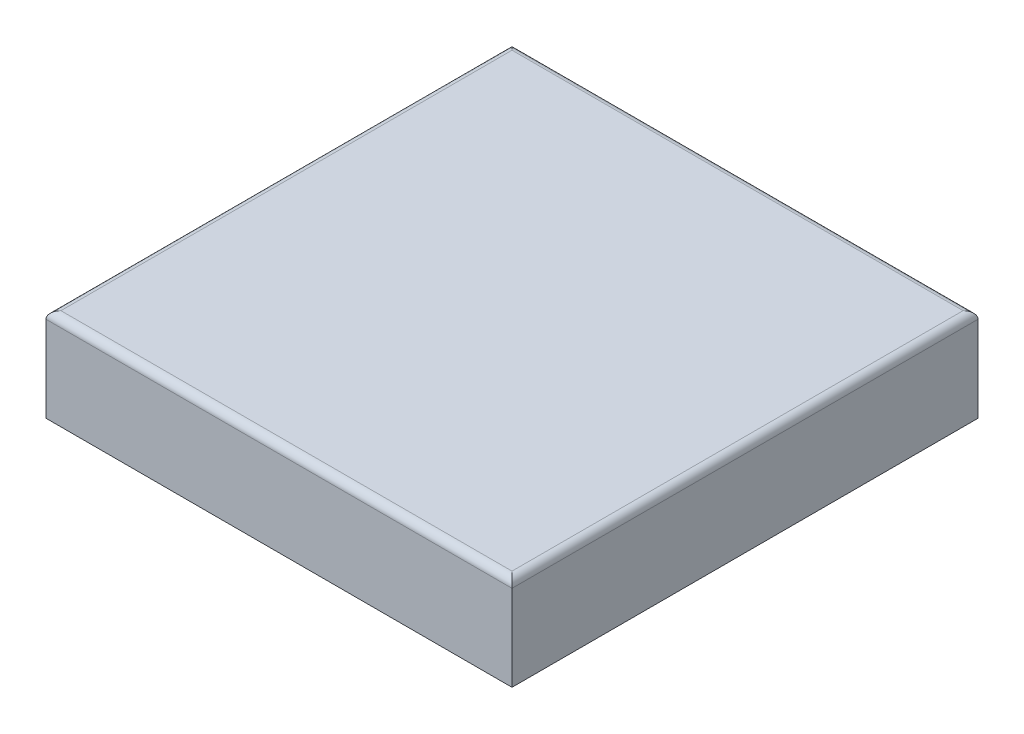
ISO-10303-21;
HEADER;
FILE_DESCRIPTION(('STEP AP214'),'2;1');
FILE_NAME('part.step','',(''),(''),'','','');
FILE_SCHEMA(('AUTOMOTIVE_DESIGN { 1 0 10303 214 1 1 1 1 }'));
ENDSEC;
DATA;
#1=APPLICATION_CONTEXT('core data for automotive mechanical design processes');
#2=APPLICATION_PROTOCOL_DEFINITION('international standard','automotive_design',2000,#1);
#3=PRODUCT_CONTEXT('',#1,'mechanical');
#4=PRODUCT('Part','Part','',(#3));
#5=PRODUCT_RELATED_PRODUCT_CATEGORY('part','',(#4));
#6=PRODUCT_DEFINITION_FORMATION('','',#4);
#7=PRODUCT_DEFINITION_CONTEXT('part definition',#1,'design');
#8=PRODUCT_DEFINITION('design','',#6,#7);
#9=PRODUCT_DEFINITION_SHAPE('','',#8);
#10=(LENGTH_UNIT() NAMED_UNIT(*) SI_UNIT(.MILLI.,.METRE.));
#11=(NAMED_UNIT(*) PLANE_ANGLE_UNIT() SI_UNIT($,.RADIAN.));
#12=(NAMED_UNIT(*) SI_UNIT($,.STERADIAN.) SOLID_ANGLE_UNIT());
#13=UNCERTAINTY_MEASURE_WITH_UNIT(LENGTH_MEASURE(1.E-05),#10,'distance_accuracy_value','');
#14=(GEOMETRIC_REPRESENTATION_CONTEXT(3) GLOBAL_UNCERTAINTY_ASSIGNED_CONTEXT((#13)) GLOBAL_UNIT_ASSIGNED_CONTEXT((#10,
#11,#12)) REPRESENTATION_CONTEXT('',''));
#15=CARTESIAN_POINT('',(0.,0.,0.));
#16=DIRECTION('',(0.,0.,1.));
#17=DIRECTION('',(1.,0.,0.));
#18=AXIS2_PLACEMENT_3D('',#15,#16,#17);
#19=CARTESIAN_POINT('',(-7.9375,1.5875,7.9375));
#20=DIRECTION('',(0.,-1.,0.));
#21=DIRECTION('',(0.,0.,-1.));
#22=AXIS2_PLACEMENT_3D('',#19,#20,#21);
#23=PLANE('',#22);
#24=CARTESIAN_POINT('',(-3.81000000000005,1.5875,0.));
#25=DIRECTION('',(0.,-1.,0.));
#26=DIRECTION('',(0.,0.,-1.));
#27=AXIS2_PLACEMENT_3D('',#24,#25,#26);
#28=CIRCLE('',#27,1.27);
#29=CARTESIAN_POINT('',(-3.81000000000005,1.5875,1.27));
#30=VERTEX_POINT('',#29);
#31=EDGE_CURVE('E233',#30,#30,#28,.T.);
#32=ORIENTED_EDGE('',*,*,#31,.F.);
#33=EDGE_LOOP('',(#32));
#34=FACE_BOUND('',#33,.T.);
#35=DIRECTION('',(0.,0.,1.));
#36=VECTOR('',#35,1.);
#37=CARTESIAN_POINT('',(-6.35,1.5875,7.9375));
#38=LINE('',#37,#36);
#39=CARTESIAN_POINT('',(-6.35,1.5875,-6.35));
#40=VERTEX_POINT('',#39);
#41=CARTESIAN_POINT('',(-6.35,1.5875,6.35));
#42=VERTEX_POINT('',#41);
#43=EDGE_CURVE('E115',#40,#42,#38,.T.);
#44=ORIENTED_EDGE('',*,*,#43,.F.);
#45=DIRECTION('',(1.,0.,0.));
#46=VECTOR('',#45,1.);
#47=CARTESIAN_POINT('',(-7.9375,1.5875,-6.35));
#48=LINE('',#47,#46);
#49=CARTESIAN_POINT('',(6.35,1.5875,-6.35));
#50=VERTEX_POINT('',#49);
#51=EDGE_CURVE('E143',#40,#50,#48,.T.);
#52=ORIENTED_EDGE('',*,*,#51,.T.);
#53=DIRECTION('',(0.,0.,-1.));
#54=VECTOR('',#53,1.);
#55=CARTESIAN_POINT('',(6.35,1.5875,7.9375));
#56=LINE('',#55,#54);
#57=CARTESIAN_POINT('',(6.35,1.5875,6.35));
#58=VERTEX_POINT('',#57);
#59=EDGE_CURVE('E141',#58,#50,#56,.T.);
#60=ORIENTED_EDGE('',*,*,#59,.F.);
#61=DIRECTION('',(-1.,0.,0.));
#62=VECTOR('',#61,1.);
#63=CARTESIAN_POINT('',(-7.9375,1.5875,6.35));
#64=LINE('',#63,#62);
#65=EDGE_CURVE('E126',#58,#42,#64,.T.);
#66=ORIENTED_EDGE('',*,*,#65,.T.);
#67=EDGE_LOOP('',(#44,#52,#60,#66));
#68=FACE_BOUND('',#67,.T.);
#69=CARTESIAN_POINT('',(0.,1.5875,3.80999999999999));
#70=DIRECTION('',(0.,-1.,0.));
#71=DIRECTION('',(0.,0.,-1.));
#72=AXIS2_PLACEMENT_3D('',#69,#70,#71);
#73=CIRCLE('',#72,1.27);
#74=CARTESIAN_POINT('',(0.,1.5875,5.07999999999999));
#75=VERTEX_POINT('',#74);
#76=EDGE_CURVE('E227',#75,#75,#73,.T.);
#77=ORIENTED_EDGE('',*,*,#76,.F.);
#78=EDGE_LOOP('',(#77));
#79=FACE_BOUND('',#78,.T.);
#80=ADVANCED_FACE('F40',(#34,#68,#79),#23,.T.);
#81=CARTESIAN_POINT('',(-7.9375,0.,7.9375));
#82=DIRECTION('',(0.,-1.,0.));
#83=DIRECTION('',(0.,0.,-1.));
#84=AXIS2_PLACEMENT_3D('',#81,#82,#83);
#85=PLANE('',#84);
#86=DIRECTION('',(0.,0.,1.));
#87=VECTOR('',#86,1.);
#88=CARTESIAN_POINT('',(-7.9375,0.,-7.9375));
#89=LINE('',#88,#87);
#90=CARTESIAN_POINT('',(-7.9375,0.,-7.9375));
#91=VERTEX_POINT('',#90);
#92=CARTESIAN_POINT('',(-7.9375,0.,7.9375));
#93=VERTEX_POINT('',#92);
#94=EDGE_CURVE('E136',#91,#93,#89,.T.);
#95=ORIENTED_EDGE('',*,*,#94,.F.);
#96=DIRECTION('',(1.,0.,0.));
#97=VECTOR('',#96,1.);
#98=CARTESIAN_POINT('',(-7.9375,0.,-7.9375));
#99=LINE('',#98,#97);
#100=CARTESIAN_POINT('',(7.9375,0.,-7.9375));
#101=VERTEX_POINT('',#100);
#102=EDGE_CURVE('E168',#91,#101,#99,.T.);
#103=ORIENTED_EDGE('',*,*,#102,.T.);
#104=DIRECTION('',(0.,0.,-1.));
#105=VECTOR('',#104,1.);
#106=CARTESIAN_POINT('',(7.9375,0.,7.9375));
#107=LINE('',#106,#105);
#108=CARTESIAN_POINT('',(7.9375,0.,7.9375));
#109=VERTEX_POINT('',#108);
#110=EDGE_CURVE('E165',#109,#101,#107,.T.);
#111=ORIENTED_EDGE('',*,*,#110,.F.);
#112=DIRECTION('',(-1.,0.,0.));
#113=VECTOR('',#112,1.);
#114=CARTESIAN_POINT('',(7.9375,0.,7.9375));
#115=LINE('',#114,#113);
#116=EDGE_CURVE('E162',#109,#93,#115,.T.);
#117=ORIENTED_EDGE('',*,*,#116,.T.);
#118=EDGE_LOOP('',(#95,#103,#111,#117));
#119=FACE_BOUND('',#118,.T.);
#120=DIRECTION('',(1.,0.,0.));
#121=VECTOR('',#120,1.);
#122=CARTESIAN_POINT('',(-7.9375,0.,-6.35));
#123=LINE('',#122,#121);
#124=CARTESIAN_POINT('',(-6.35,0.,-6.35));
#125=VERTEX_POINT('',#124);
#126=CARTESIAN_POINT('',(6.35,0.,-6.35));
#127=VERTEX_POINT('',#126);
#128=EDGE_CURVE('E127',#125,#127,#123,.T.);
#129=ORIENTED_EDGE('',*,*,#128,.F.);
#130=DIRECTION('',(0.,0.,1.));
#131=VECTOR('',#130,1.);
#132=CARTESIAN_POINT('',(-6.35,0.,7.9375));
#133=LINE('',#132,#131);
#134=CARTESIAN_POINT('',(-6.35,0.,6.35));
#135=VERTEX_POINT('',#134);
#136=EDGE_CURVE('E151',#125,#135,#133,.T.);
#137=ORIENTED_EDGE('',*,*,#136,.T.);
#138=DIRECTION('',(-1.,0.,0.));
#139=VECTOR('',#138,1.);
#140=CARTESIAN_POINT('',(-7.9375,0.,6.35));
#141=LINE('',#140,#139);
#142=CARTESIAN_POINT('',(6.35,0.,6.35));
#143=VERTEX_POINT('',#142);
#144=EDGE_CURVE('E134',#143,#135,#141,.T.);
#145=ORIENTED_EDGE('',*,*,#144,.F.);
#146=DIRECTION('',(0.,0.,-1.));
#147=VECTOR('',#146,1.);
#148=CARTESIAN_POINT('',(6.35,0.,7.9375));
#149=LINE('',#148,#147);
#150=EDGE_CURVE('E156',#143,#127,#149,.T.);
#151=ORIENTED_EDGE('',*,*,#150,.T.);
#152=EDGE_LOOP('',(#129,#137,#145,#151));
#153=FACE_BOUND('',#152,.T.);
#154=ADVANCED_FACE('F242',(#119,#153),#85,.T.);
#155=CARTESIAN_POINT('',(-7.9375,3.175,-7.9375));
#156=DIRECTION('',(1.,0.,0.));
#157=DIRECTION('',(0.,0.,-1.));
#158=AXIS2_PLACEMENT_3D('',#155,#156,#157);
#159=PLANE('',#158);
#160=DIRECTION('',(0.,-1.,0.));
#161=VECTOR('',#160,1.);
#162=CARTESIAN_POINT('',(-7.9375,3.175,7.9375));
#163=LINE('',#162,#161);
#164=CARTESIAN_POINT('',(-7.9375,2.921,7.9375));
#165=VERTEX_POINT('',#164);
#166=EDGE_CURVE('E177',#165,#93,#163,.T.);
#167=ORIENTED_EDGE('',*,*,#166,.F.);
#168=DIRECTION('',(0.,0.,1.));
#169=VECTOR('',#168,1.);
#170=CARTESIAN_POINT('',(-7.9375,2.921,-7.9375));
#171=LINE('',#170,#169);
#172=CARTESIAN_POINT('',(-7.9375,2.921,-7.9375));
#173=VERTEX_POINT('',#172);
#174=EDGE_CURVE('E11',#165,#173,#171,.F.);
#175=ORIENTED_EDGE('',*,*,#174,.T.);
#176=DIRECTION('',(0.,-1.,0.));
#177=VECTOR('',#176,1.);
#178=CARTESIAN_POINT('',(-7.9375,3.175,-7.9375));
#179=LINE('',#178,#177);
#180=EDGE_CURVE('E171',#173,#91,#179,.T.);
#181=ORIENTED_EDGE('',*,*,#180,.T.);
#182=ORIENTED_EDGE('',*,*,#94,.T.);
#183=EDGE_LOOP('',(#167,#175,#181,#182));
#184=FACE_BOUND('',#183,.T.);
#185=ADVANCED_FACE('F42',(#184),#159,.F.);
#186=CARTESIAN_POINT('',(7.9375,3.175,7.9375));
#187=DIRECTION('',(0.,0.,1.));
#188=DIRECTION('',(1.,0.,0.));
#189=AXIS2_PLACEMENT_3D('',#186,#187,#188);
#190=PLANE('',#189);
#191=DIRECTION('',(0.,-1.,0.));
#192=VECTOR('',#191,1.);
#193=CARTESIAN_POINT('',(7.9375,3.175,7.9375));
#194=LINE('',#193,#192);
#195=CARTESIAN_POINT('',(7.9375,2.921,7.9375));
#196=VERTEX_POINT('',#195);
#197=EDGE_CURVE('E175',#196,#109,#194,.T.);
#198=ORIENTED_EDGE('',*,*,#197,.F.);
#199=DIRECTION('',(-1.,0.,0.));
#200=VECTOR('',#199,1.);
#201=CARTESIAN_POINT('',(-7.9375,2.921,7.9375));
#202=LINE('',#201,#200);
#203=EDGE_CURVE('E48',#196,#165,#202,.T.);
#204=ORIENTED_EDGE('',*,*,#203,.T.);
#205=ORIENTED_EDGE('',*,*,#166,.T.);
#206=ORIENTED_EDGE('',*,*,#116,.F.);
#207=EDGE_LOOP('',(#198,#204,#205,#206));
#208=FACE_BOUND('',#207,.T.);
#209=ADVANCED_FACE('F272',(#208),#190,.T.);
#210=CARTESIAN_POINT('',(7.9375,3.175,7.9375));
#211=DIRECTION('',(-1.,0.,0.));
#212=DIRECTION('',(0.,0.,1.));
#213=AXIS2_PLACEMENT_3D('',#210,#211,#212);
#214=PLANE('',#213);
#215=DIRECTION('',(0.,-1.,0.));
#216=VECTOR('',#215,1.);
#217=CARTESIAN_POINT('',(7.9375,3.175,-7.9375));
#218=LINE('',#217,#216);
#219=CARTESIAN_POINT('',(7.9375,2.921,-7.9375));
#220=VERTEX_POINT('',#219);
#221=EDGE_CURVE('E173',#220,#101,#218,.T.);
#222=ORIENTED_EDGE('',*,*,#221,.F.);
#223=DIRECTION('',(0.,0.,-1.));
#224=VECTOR('',#223,1.);
#225=CARTESIAN_POINT('',(7.9375,2.921,7.9375));
#226=LINE('',#225,#224);
#227=EDGE_CURVE('E62',#220,#196,#226,.F.);
#228=ORIENTED_EDGE('',*,*,#227,.T.);
#229=ORIENTED_EDGE('',*,*,#197,.T.);
#230=ORIENTED_EDGE('',*,*,#110,.T.);
#231=EDGE_LOOP('',(#222,#228,#229,#230));
#232=FACE_BOUND('',#231,.T.);
#233=ADVANCED_FACE('F269',(#232),#214,.F.);
#234=CARTESIAN_POINT('',(-7.9375,3.175,-7.9375));
#235=DIRECTION('',(0.,0.,-1.));
#236=DIRECTION('',(-1.,0.,0.));
#237=AXIS2_PLACEMENT_3D('',#234,#235,#236);
#238=PLANE('',#237);
#239=ORIENTED_EDGE('',*,*,#180,.F.);
#240=DIRECTION('',(1.,0.,0.));
#241=VECTOR('',#240,1.);
#242=CARTESIAN_POINT('',(7.9375,2.921,-7.9375));
#243=LINE('',#242,#241);
#244=EDGE_CURVE('E179',#173,#220,#243,.T.);
#245=ORIENTED_EDGE('',*,*,#244,.T.);
#246=ORIENTED_EDGE('',*,*,#221,.T.);
#247=ORIENTED_EDGE('',*,*,#102,.F.);
#248=EDGE_LOOP('',(#239,#245,#246,#247));
#249=FACE_BOUND('',#248,.T.);
#250=ADVANCED_FACE('F266',(#249),#238,.T.);
#251=CARTESIAN_POINT('',(-7.9375,3.175,7.9375));
#252=DIRECTION('',(0.,-1.,0.));
#253=DIRECTION('',(0.,0.,-1.));
#254=AXIS2_PLACEMENT_3D('',#251,#252,#253);
#255=PLANE('',#254);
#256=DIRECTION('',(0.,0.,-1.));
#257=VECTOR('',#256,1.);
#258=CARTESIAN_POINT('',(7.6835,3.175,7.9375));
#259=LINE('',#258,#257);
#260=CARTESIAN_POINT('',(7.6835,3.175,7.6835));
#261=VERTEX_POINT('',#260);
#262=CARTESIAN_POINT('',(7.6835,3.175,-7.6835));
#263=VERTEX_POINT('',#262);
#264=EDGE_CURVE('E186',#261,#263,#259,.T.);
#265=ORIENTED_EDGE('',*,*,#264,.T.);
#266=DIRECTION('',(1.,0.,0.));
#267=VECTOR('',#266,1.);
#268=CARTESIAN_POINT('',(-7.9375,3.175,-7.6835));
#269=LINE('',#268,#267);
#270=CARTESIAN_POINT('',(-7.6835,3.175,-7.6835));
#271=VERTEX_POINT('',#270);
#272=EDGE_CURVE('E188',#263,#271,#269,.F.);
#273=ORIENTED_EDGE('',*,*,#272,.T.);
#274=DIRECTION('',(0.,0.,1.));
#275=VECTOR('',#274,1.);
#276=CARTESIAN_POINT('',(-7.6835,3.175,7.9375));
#277=LINE('',#276,#275);
#278=CARTESIAN_POINT('',(-7.6835,3.175,7.6835));
#279=VERTEX_POINT('',#278);
#280=EDGE_CURVE('E182',#271,#279,#277,.T.);
#281=ORIENTED_EDGE('',*,*,#280,.T.);
#282=DIRECTION('',(-1.,0.,0.));
#283=VECTOR('',#282,1.);
#284=CARTESIAN_POINT('',(7.9375,3.175,7.6835));
#285=LINE('',#284,#283);
#286=EDGE_CURVE('E184',#279,#261,#285,.F.);
#287=ORIENTED_EDGE('',*,*,#286,.T.);
#288=EDGE_LOOP('',(#265,#273,#281,#287));
#289=FACE_BOUND('',#288,.T.);
#290=ADVANCED_FACE('F193',(#289),#255,.F.);
#291=CARTESIAN_POINT('',(-6.35,3.175,-7.9375));
#292=DIRECTION('',(1.,0.,0.));
#293=DIRECTION('',(0.,0.,-1.));
#294=AXIS2_PLACEMENT_3D('',#291,#292,#293);
#295=PLANE('',#294);
#296=ORIENTED_EDGE('',*,*,#136,.F.);
#297=DIRECTION('',(0.,-1.,0.));
#298=VECTOR('',#297,1.);
#299=CARTESIAN_POINT('',(-6.35,3.175,-6.35));
#300=LINE('',#299,#298);
#301=EDGE_CURVE('E121',#40,#125,#300,.T.);
#302=ORIENTED_EDGE('',*,*,#301,.F.);
#303=ORIENTED_EDGE('',*,*,#43,.T.);
#304=DIRECTION('',(0.,-1.,0.));
#305=VECTOR('',#304,1.);
#306=CARTESIAN_POINT('',(-6.35,3.175,6.35));
#307=LINE('',#306,#305);
#308=EDGE_CURVE('E119',#42,#135,#307,.T.);
#309=ORIENTED_EDGE('',*,*,#308,.T.);
#310=EDGE_LOOP('',(#296,#302,#303,#309));
#311=FACE_BOUND('',#310,.T.);
#312=ADVANCED_FACE('F118',(#311),#295,.T.);
#313=CARTESIAN_POINT('',(7.9375,3.175,6.35));
#314=DIRECTION('',(0.,0.,1.));
#315=DIRECTION('',(1.,0.,0.));
#316=AXIS2_PLACEMENT_3D('',#313,#314,#315);
#317=PLANE('',#316);
#318=ORIENTED_EDGE('',*,*,#144,.T.);
#319=ORIENTED_EDGE('',*,*,#308,.F.);
#320=ORIENTED_EDGE('',*,*,#65,.F.);
#321=DIRECTION('',(0.,-1.,0.));
#322=VECTOR('',#321,1.);
#323=CARTESIAN_POINT('',(6.35,3.175,6.35));
#324=LINE('',#323,#322);
#325=EDGE_CURVE('E137',#58,#143,#324,.T.);
#326=ORIENTED_EDGE('',*,*,#325,.T.);
#327=EDGE_LOOP('',(#318,#319,#320,#326));
#328=FACE_BOUND('',#327,.T.);
#329=ADVANCED_FACE('F131',(#328),#317,.F.);
#330=CARTESIAN_POINT('',(6.35,3.175,7.9375));
#331=DIRECTION('',(-1.,0.,0.));
#332=DIRECTION('',(0.,0.,1.));
#333=AXIS2_PLACEMENT_3D('',#330,#331,#332);
#334=PLANE('',#333);
#335=ORIENTED_EDGE('',*,*,#150,.F.);
#336=ORIENTED_EDGE('',*,*,#325,.F.);
#337=ORIENTED_EDGE('',*,*,#59,.T.);
#338=DIRECTION('',(0.,-1.,0.));
#339=VECTOR('',#338,1.);
#340=CARTESIAN_POINT('',(6.35,3.175,-6.35));
#341=LINE('',#340,#339);
#342=EDGE_CURVE('E148',#50,#127,#341,.T.);
#343=ORIENTED_EDGE('',*,*,#342,.T.);
#344=EDGE_LOOP('',(#335,#336,#337,#343));
#345=FACE_BOUND('',#344,.T.);
#346=ADVANCED_FACE('F244',(#345),#334,.T.);
#347=CARTESIAN_POINT('',(-7.9375,3.175,-6.35));
#348=DIRECTION('',(0.,0.,-1.));
#349=DIRECTION('',(-1.,0.,0.));
#350=AXIS2_PLACEMENT_3D('',#347,#348,#349);
#351=PLANE('',#350);
#352=ORIENTED_EDGE('',*,*,#128,.T.);
#353=ORIENTED_EDGE('',*,*,#342,.F.);
#354=ORIENTED_EDGE('',*,*,#51,.F.);
#355=ORIENTED_EDGE('',*,*,#301,.T.);
#356=EDGE_LOOP('',(#352,#353,#354,#355));
#357=FACE_BOUND('',#356,.T.);
#358=ADVANCED_FACE('F238',(#357),#351,.F.);
#359=CARTESIAN_POINT('',(-3.81000000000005,-3.59210244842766,0.));
#360=DIRECTION('',(0.,1.,0.));
#361=DIRECTION('',(0.,0.,1.));
#362=AXIS2_PLACEMENT_3D('',#359,#360,#361);
#363=CYLINDRICAL_SURFACE('',#362,1.27);
#364=CARTESIAN_POINT('',(-3.81000000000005,0.,0.));
#365=DIRECTION('',(0.,-1.,0.));
#366=DIRECTION('',(0.,0.,-1.));
#367=AXIS2_PLACEMENT_3D('',#364,#365,#366);
#368=CIRCLE('',#367,1.27);
#369=CARTESIAN_POINT('',(-3.81000000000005,0.,1.27));
#370=VERTEX_POINT('',#369);
#371=EDGE_CURVE('E153',#370,#370,#368,.T.);
#372=CARTESIAN_POINT('',(-3.81000000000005,1.5875,1.27));
#373=CARTESIAN_POINT('',(-3.81000000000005,1.57096354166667,1.27));
#374=CARTESIAN_POINT('',(-3.81000000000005,1.55442708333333,1.27));
#375=CARTESIAN_POINT('',(-3.81000000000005,1.52135416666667,1.27));
#376=CARTESIAN_POINT('',(-3.81000000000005,1.50481770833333,1.27));
#377=CARTESIAN_POINT('',(-3.81000000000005,1.47174479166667,1.27));
#378=CARTESIAN_POINT('',(-3.81000000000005,1.45520833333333,1.27));
#379=CARTESIAN_POINT('',(-3.81000000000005,1.42213541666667,1.27));
#380=CARTESIAN_POINT('',(-3.81000000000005,1.40559895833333,1.27));
#381=CARTESIAN_POINT('',(-3.81000000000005,1.37252604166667,1.27));
#382=CARTESIAN_POINT('',(-3.81000000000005,1.35598958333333,1.27));
#383=CARTESIAN_POINT('',(-3.81000000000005,1.32291666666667,1.27));
#384=CARTESIAN_POINT('',(-3.81000000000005,1.30638020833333,1.27));
#385=CARTESIAN_POINT('',(-3.81000000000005,1.27330729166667,1.27));
#386=CARTESIAN_POINT('',(-3.81000000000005,1.25677083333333,1.27));
#387=CARTESIAN_POINT('',(-3.81000000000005,1.22369791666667,1.27));
#388=CARTESIAN_POINT('',(-3.81000000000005,1.20716145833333,1.27));
#389=CARTESIAN_POINT('',(-3.81000000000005,1.17408854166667,1.27));
#390=CARTESIAN_POINT('',(-3.81000000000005,1.15755208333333,1.27));
#391=CARTESIAN_POINT('',(-3.81000000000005,1.12447916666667,1.27));
#392=CARTESIAN_POINT('',(-3.81000000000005,1.10794270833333,1.27));
#393=CARTESIAN_POINT('',(-3.81000000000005,1.07486979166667,1.27));
#394=CARTESIAN_POINT('',(-3.81000000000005,1.05833333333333,1.27));
#395=CARTESIAN_POINT('',(-3.81000000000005,1.02526041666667,1.27));
#396=CARTESIAN_POINT('',(-3.81000000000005,1.00872395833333,1.27));
#397=CARTESIAN_POINT('',(-3.81000000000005,0.975651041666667,1.27));
#398=CARTESIAN_POINT('',(-3.81000000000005,0.959114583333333,1.27));
#399=CARTESIAN_POINT('',(-3.81000000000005,0.926041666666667,1.27));
#400=CARTESIAN_POINT('',(-3.81000000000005,0.909505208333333,1.27));
#401=CARTESIAN_POINT('',(-3.81000000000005,0.876432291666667,1.27));
#402=CARTESIAN_POINT('',(-3.81000000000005,0.859895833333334,1.27));
#403=CARTESIAN_POINT('',(-3.81000000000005,0.826822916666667,1.27));
#404=CARTESIAN_POINT('',(-3.81000000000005,0.810286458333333,1.27));
#405=CARTESIAN_POINT('',(-3.81000000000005,0.777213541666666,1.27));
#406=CARTESIAN_POINT('',(-3.81000000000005,0.760677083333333,1.27));
#407=CARTESIAN_POINT('',(-3.81000000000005,0.727604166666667,1.27));
#408=CARTESIAN_POINT('',(-3.81000000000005,0.711067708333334,1.27));
#409=CARTESIAN_POINT('',(-3.81000000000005,0.677994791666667,1.27));
#410=CARTESIAN_POINT('',(-3.81000000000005,0.661458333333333,1.27));
#411=CARTESIAN_POINT('',(-3.81000000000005,0.628385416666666,1.27));
#412=CARTESIAN_POINT('',(-3.81000000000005,0.611848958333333,1.27));
#413=CARTESIAN_POINT('',(-3.81000000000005,0.578776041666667,1.27));
#414=CARTESIAN_POINT('',(-3.81000000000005,0.562239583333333,1.27));
#415=CARTESIAN_POINT('',(-3.81000000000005,0.529166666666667,1.27));
#416=CARTESIAN_POINT('',(-3.81000000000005,0.512630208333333,1.27));
#417=CARTESIAN_POINT('',(-3.81000000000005,0.479557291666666,1.27));
#418=CARTESIAN_POINT('',(-3.81000000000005,0.463020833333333,1.27));
#419=CARTESIAN_POINT('',(-3.81000000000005,0.429947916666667,1.27));
#420=CARTESIAN_POINT('',(-3.81000000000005,0.413411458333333,1.27));
#421=CARTESIAN_POINT('',(-3.81000000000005,0.380338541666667,1.27));
#422=CARTESIAN_POINT('',(-3.81000000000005,0.363802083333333,1.27));
#423=CARTESIAN_POINT('',(-3.81000000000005,0.330729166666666,1.27));
#424=CARTESIAN_POINT('',(-3.81000000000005,0.314192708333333,1.27));
#425=CARTESIAN_POINT('',(-3.81000000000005,0.281119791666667,1.27));
#426=CARTESIAN_POINT('',(-3.81000000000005,0.264583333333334,1.27));
#427=CARTESIAN_POINT('',(-3.81000000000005,0.231510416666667,1.27));
#428=CARTESIAN_POINT('',(-3.81000000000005,0.214973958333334,1.27));
#429=CARTESIAN_POINT('',(-3.81000000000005,0.181901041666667,1.27));
#430=CARTESIAN_POINT('',(-3.81000000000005,0.165364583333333,1.27));
#431=CARTESIAN_POINT('',(-3.81000000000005,0.132291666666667,1.27));
#432=CARTESIAN_POINT('',(-3.81000000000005,0.115755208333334,1.27));
#433=CARTESIAN_POINT('',(-3.81000000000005,0.0826822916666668,1.27));
#434=CARTESIAN_POINT('',(-3.81000000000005,0.0661458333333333,1.27));
#435=CARTESIAN_POINT('',(-3.81000000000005,0.0330729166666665,1.27));
#436=CARTESIAN_POINT('',(-3.81000000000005,0.0165364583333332,1.27));
#437=CARTESIAN_POINT('',(-3.81000000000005,0.,1.27));
#438=B_SPLINE_CURVE_WITH_KNOTS('',3,(#372,#373,#374,#375,#376,#377,#378,#379,#380,#381,#382,
#383,#384,#385,#386,#387,#388,#389,#390,#391,#392,#393,#394,#395,#396,#397,#398,#399,#400,#401,
#402,#403,#404,#405,#406,#407,#408,#409,#410,#411,#412,#413,#414,#415,#416,#417,#418,#419,#420,
#421,#422,#423,#424,#425,#426,#427,#428,#429,#430,#431,#432,#433,#434,#435,#436,#437),
.UNSPECIFIED.,.F.,.F.,(4,2,2,2,2,2,2,2,2,2,2,2,2,2,2,2,2,2,2,2,2,2,2,2,2,2,2,2,2,2,2,2,4),(0.,
0.0496093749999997,0.0992187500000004,0.148828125,0.1984375,0.248046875,0.29765625,0.347265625,
0.396875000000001,0.446484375,0.496093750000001,0.545703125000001,0.5953125,0.644921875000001,
0.694531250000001,0.744140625,0.793750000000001,0.843359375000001,0.892968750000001,
0.942578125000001,0.992187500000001,1.041796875,1.09140625,1.141015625,1.190625,1.240234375,
1.28984375,1.339453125,1.3890625,1.438671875,1.48828125,1.537890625,1.5875),.UNSPECIFIED.);
#439=EDGE_CURVE('BSEAM251',#30,#370,#438,.T.);
#440=ORIENTED_EDGE('',*,*,#31,.T.);
#441=ORIENTED_EDGE('',*,*,#371,.F.);
#442=ORIENTED_EDGE('',*,*,#439,.T.);
#443=ORIENTED_EDGE('',*,*,#439,.F.);
#444=EDGE_LOOP('',(#440,#442,#441,#443));
#445=FACE_BOUND('',#444,.T.);
#446=ADVANCED_FACE('F251',(#445),#363,.T.);
#447=CARTESIAN_POINT('',(-7.9375,0.,7.9375));
#448=DIRECTION('',(0.,-1.,0.));
#449=DIRECTION('',(0.,0.,-1.));
#450=AXIS2_PLACEMENT_3D('',#447,#448,#449);
#451=PLANE('',#450);
#452=CARTESIAN_POINT('',(-3.81000000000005,0.,0.));
#453=DIRECTION('',(0.,-1.,0.));
#454=DIRECTION('',(0.,0.,-1.));
#455=AXIS2_PLACEMENT_3D('',#452,#453,#454);
#456=CIRCLE('',#455,0.635);
#457=CARTESIAN_POINT('',(-3.81000000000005,0.,-0.635));
#458=VERTEX_POINT('',#457);
#459=EDGE_CURVE('E215',#458,#458,#456,.T.);
#460=ORIENTED_EDGE('',*,*,#459,.F.);
#461=EDGE_LOOP('',(#460));
#462=FACE_BOUND('',#461,.T.);
#463=ORIENTED_EDGE('',*,*,#371,.T.);
#464=EDGE_LOOP('',(#463));
#465=FACE_BOUND('',#464,.T.);
#466=ADVANCED_FACE('F320',(#462,#465),#451,.T.);
#467=CARTESIAN_POINT('',(0.,-3.59210244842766,3.80999999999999));
#468=DIRECTION('',(0.,1.,0.));
#469=DIRECTION('',(0.,0.,1.));
#470=AXIS2_PLACEMENT_3D('',#467,#468,#469);
#471=CYLINDRICAL_SURFACE('',#470,1.27);
#472=CARTESIAN_POINT('',(0.,0.,3.80999999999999));
#473=DIRECTION('',(0.,-1.,0.));
#474=DIRECTION('',(0.,0.,-1.));
#475=AXIS2_PLACEMENT_3D('',#472,#473,#474);
#476=CIRCLE('',#475,1.27);
#477=CARTESIAN_POINT('',(0.,0.,5.07999999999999));
#478=VERTEX_POINT('',#477);
#479=EDGE_CURVE('E230',#478,#478,#476,.T.);
#480=CARTESIAN_POINT('',(0.,1.5875,5.07999999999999));
#481=CARTESIAN_POINT('',(0.,1.57096354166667,5.07999999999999));
#482=CARTESIAN_POINT('',(0.,1.55442708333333,5.07999999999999));
#483=CARTESIAN_POINT('',(0.,1.52135416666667,5.07999999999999));
#484=CARTESIAN_POINT('',(0.,1.50481770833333,5.07999999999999));
#485=CARTESIAN_POINT('',(0.,1.47174479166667,5.07999999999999));
#486=CARTESIAN_POINT('',(0.,1.45520833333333,5.07999999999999));
#487=CARTESIAN_POINT('',(0.,1.42213541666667,5.07999999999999));
#488=CARTESIAN_POINT('',(0.,1.40559895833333,5.07999999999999));
#489=CARTESIAN_POINT('',(0.,1.37252604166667,5.07999999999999));
#490=CARTESIAN_POINT('',(0.,1.35598958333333,5.07999999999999));
#491=CARTESIAN_POINT('',(0.,1.32291666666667,5.07999999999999));
#492=CARTESIAN_POINT('',(0.,1.30638020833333,5.07999999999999));
#493=CARTESIAN_POINT('',(0.,1.27330729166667,5.07999999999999));
#494=CARTESIAN_POINT('',(0.,1.25677083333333,5.07999999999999));
#495=CARTESIAN_POINT('',(0.,1.22369791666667,5.07999999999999));
#496=CARTESIAN_POINT('',(0.,1.20716145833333,5.07999999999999));
#497=CARTESIAN_POINT('',(0.,1.17408854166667,5.07999999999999));
#498=CARTESIAN_POINT('',(0.,1.15755208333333,5.07999999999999));
#499=CARTESIAN_POINT('',(0.,1.12447916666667,5.07999999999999));
#500=CARTESIAN_POINT('',(0.,1.10794270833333,5.07999999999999));
#501=CARTESIAN_POINT('',(0.,1.07486979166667,5.07999999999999));
#502=CARTESIAN_POINT('',(0.,1.05833333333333,5.07999999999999));
#503=CARTESIAN_POINT('',(0.,1.02526041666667,5.07999999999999));
#504=CARTESIAN_POINT('',(0.,1.00872395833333,5.07999999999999));
#505=CARTESIAN_POINT('',(0.,0.975651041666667,5.07999999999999));
#506=CARTESIAN_POINT('',(0.,0.959114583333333,5.07999999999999));
#507=CARTESIAN_POINT('',(0.,0.926041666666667,5.07999999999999));
#508=CARTESIAN_POINT('',(0.,0.909505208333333,5.07999999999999));
#509=CARTESIAN_POINT('',(0.,0.876432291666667,5.07999999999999));
#510=CARTESIAN_POINT('',(0.,0.859895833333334,5.07999999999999));
#511=CARTESIAN_POINT('',(0.,0.826822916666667,5.07999999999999));
#512=CARTESIAN_POINT('',(0.,0.810286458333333,5.07999999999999));
#513=CARTESIAN_POINT('',(0.,0.777213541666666,5.07999999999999));
#514=CARTESIAN_POINT('',(0.,0.760677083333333,5.07999999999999));
#515=CARTESIAN_POINT('',(0.,0.727604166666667,5.07999999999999));
#516=CARTESIAN_POINT('',(0.,0.711067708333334,5.07999999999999));
#517=CARTESIAN_POINT('',(0.,0.677994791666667,5.07999999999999));
#518=CARTESIAN_POINT('',(0.,0.661458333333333,5.07999999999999));
#519=CARTESIAN_POINT('',(0.,0.628385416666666,5.07999999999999));
#520=CARTESIAN_POINT('',(0.,0.611848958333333,5.07999999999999));
#521=CARTESIAN_POINT('',(0.,0.578776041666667,5.07999999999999));
#522=CARTESIAN_POINT('',(0.,0.562239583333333,5.07999999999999));
#523=CARTESIAN_POINT('',(0.,0.529166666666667,5.07999999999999));
#524=CARTESIAN_POINT('',(0.,0.512630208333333,5.07999999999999));
#525=CARTESIAN_POINT('',(0.,0.479557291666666,5.07999999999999));
#526=CARTESIAN_POINT('',(0.,0.463020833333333,5.07999999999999));
#527=CARTESIAN_POINT('',(0.,0.429947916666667,5.07999999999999));
#528=CARTESIAN_POINT('',(0.,0.413411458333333,5.07999999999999));
#529=CARTESIAN_POINT('',(0.,0.380338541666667,5.07999999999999));
#530=CARTESIAN_POINT('',(0.,0.363802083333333,5.07999999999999));
#531=CARTESIAN_POINT('',(0.,0.330729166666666,5.07999999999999));
#532=CARTESIAN_POINT('',(0.,0.314192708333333,5.07999999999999));
#533=CARTESIAN_POINT('',(0.,0.281119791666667,5.07999999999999));
#534=CARTESIAN_POINT('',(0.,0.264583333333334,5.07999999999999));
#535=CARTESIAN_POINT('',(0.,0.231510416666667,5.07999999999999));
#536=CARTESIAN_POINT('',(0.,0.214973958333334,5.07999999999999));
#537=CARTESIAN_POINT('',(0.,0.181901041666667,5.07999999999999));
#538=CARTESIAN_POINT('',(0.,0.165364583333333,5.07999999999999));
#539=CARTESIAN_POINT('',(0.,0.132291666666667,5.07999999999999));
#540=CARTESIAN_POINT('',(0.,0.115755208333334,5.07999999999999));
#541=CARTESIAN_POINT('',(0.,0.0826822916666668,5.07999999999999));
#542=CARTESIAN_POINT('',(0.,0.0661458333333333,5.07999999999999));
#543=CARTESIAN_POINT('',(0.,0.0330729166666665,5.07999999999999));
#544=CARTESIAN_POINT('',(0.,0.0165364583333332,5.07999999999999));
#545=CARTESIAN_POINT('',(0.,0.,5.07999999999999));
#546=B_SPLINE_CURVE_WITH_KNOTS('',3,(#480,#481,#482,#483,#484,#485,#486,#487,#488,#489,#490,
#491,#492,#493,#494,#495,#496,#497,#498,#499,#500,#501,#502,#503,#504,#505,#506,#507,#508,#509,
#510,#511,#512,#513,#514,#515,#516,#517,#518,#519,#520,#521,#522,#523,#524,#525,#526,#527,#528,
#529,#530,#531,#532,#533,#534,#535,#536,#537,#538,#539,#540,#541,#542,#543,#544,#545),
.UNSPECIFIED.,.F.,.F.,(4,2,2,2,2,2,2,2,2,2,2,2,2,2,2,2,2,2,2,2,2,2,2,2,2,2,2,2,2,2,2,2,4),(0.,
0.0496093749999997,0.0992187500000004,0.148828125,0.1984375,0.248046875,0.29765625,0.347265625,
0.396875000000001,0.446484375,0.496093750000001,0.545703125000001,0.5953125,0.644921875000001,
0.694531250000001,0.744140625,0.793750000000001,0.843359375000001,0.892968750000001,
0.942578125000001,0.992187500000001,1.041796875,1.09140625,1.141015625,1.190625,1.240234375,
1.28984375,1.339453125,1.3890625,1.438671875,1.48828125,1.537890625,1.5875),.UNSPECIFIED.);
#547=EDGE_CURVE('BSEAM317',#75,#478,#546,.T.);
#548=ORIENTED_EDGE('',*,*,#76,.T.);
#549=ORIENTED_EDGE('',*,*,#479,.F.);
#550=ORIENTED_EDGE('',*,*,#547,.T.);
#551=ORIENTED_EDGE('',*,*,#547,.F.);
#552=EDGE_LOOP('',(#548,#550,#549,#551));
#553=FACE_BOUND('',#552,.T.);
#554=ADVANCED_FACE('F317',(#553),#471,.T.);
#555=CARTESIAN_POINT('',(-7.9375,0.,7.9375));
#556=DIRECTION('',(0.,-1.,0.));
#557=DIRECTION('',(0.,0.,-1.));
#558=AXIS2_PLACEMENT_3D('',#555,#556,#557);
#559=PLANE('',#558);
#560=CARTESIAN_POINT('',(0.,0.,3.80999999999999));
#561=DIRECTION('',(0.,-1.,0.));
#562=DIRECTION('',(0.,0.,-1.));
#563=AXIS2_PLACEMENT_3D('',#560,#561,#562);
#564=CIRCLE('',#563,0.635);
#565=CARTESIAN_POINT('',(0.,0.,3.17499999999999));
#566=VERTEX_POINT('',#565);
#567=EDGE_CURVE('E221',#566,#566,#564,.T.);
#568=ORIENTED_EDGE('',*,*,#567,.F.);
#569=EDGE_LOOP('',(#568));
#570=FACE_BOUND('',#569,.T.);
#571=ORIENTED_EDGE('',*,*,#479,.T.);
#572=EDGE_LOOP('',(#571));
#573=FACE_BOUND('',#572,.T.);
#574=ADVANCED_FACE('F315',(#570,#573),#559,.T.);
#575=CARTESIAN_POINT('',(0.,3.38355122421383,3.80999999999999));
#576=DIRECTION('',(0.,-1.,0.));
#577=DIRECTION('',(0.,0.,-1.));
#578=AXIS2_PLACEMENT_3D('',#575,#576,#577);
#579=CYLINDRICAL_SURFACE('',#578,0.635);
#580=CARTESIAN_POINT('',(0.,1.5875,3.80999999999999));
#581=DIRECTION('',(0.,-1.,0.));
#582=DIRECTION('',(0.,0.,-1.));
#583=AXIS2_PLACEMENT_3D('',#580,#581,#582);
#584=CIRCLE('',#583,0.635);
#585=CARTESIAN_POINT('',(0.,1.5875,3.17499999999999));
#586=VERTEX_POINT('',#585);
#587=EDGE_CURVE('E224',#586,#586,#584,.F.);
#588=ORIENTED_EDGE('',*,*,#587,.T.);
#589=EDGE_LOOP('',(#588));
#590=FACE_BOUND('',#589,.T.);
#591=ORIENTED_EDGE('',*,*,#567,.T.);
#592=EDGE_LOOP('',(#591));
#593=FACE_BOUND('',#592,.T.);
#594=ADVANCED_FACE('F311',(#590,#593),#579,.F.);
#595=CARTESIAN_POINT('',(-7.9375,1.5875,7.9375));
#596=DIRECTION('',(0.,-1.,0.));
#597=DIRECTION('',(0.,0.,-1.));
#598=AXIS2_PLACEMENT_3D('',#595,#596,#597);
#599=PLANE('',#598);
#600=ORIENTED_EDGE('',*,*,#587,.F.);
#601=EDGE_LOOP('',(#600));
#602=FACE_BOUND('',#601,.T.);
#603=ADVANCED_FACE('F307',(#602),#599,.T.);
#604=CARTESIAN_POINT('',(-3.81000000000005,3.38355122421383,0.));
#605=DIRECTION('',(0.,-1.,0.));
#606=DIRECTION('',(0.,0.,-1.));
#607=AXIS2_PLACEMENT_3D('',#604,#605,#606);
#608=CYLINDRICAL_SURFACE('',#607,0.635);
#609=CARTESIAN_POINT('',(-3.81000000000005,1.5875,0.));
#610=DIRECTION('',(0.,-1.,0.));
#611=DIRECTION('',(0.,0.,-1.));
#612=AXIS2_PLACEMENT_3D('',#609,#610,#611);
#613=CIRCLE('',#612,0.635);
#614=CARTESIAN_POINT('',(-3.81000000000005,1.5875,-0.635));
#615=VERTEX_POINT('',#614);
#616=EDGE_CURVE('E218',#615,#615,#613,.F.);
#617=ORIENTED_EDGE('',*,*,#616,.T.);
#618=EDGE_LOOP('',(#617));
#619=FACE_BOUND('',#618,.T.);
#620=ORIENTED_EDGE('',*,*,#459,.T.);
#621=EDGE_LOOP('',(#620));
#622=FACE_BOUND('',#621,.T.);
#623=ADVANCED_FACE('F303',(#619,#622),#608,.F.);
#624=CARTESIAN_POINT('',(-7.9375,1.5875,7.9375));
#625=DIRECTION('',(0.,-1.,0.));
#626=DIRECTION('',(0.,0.,-1.));
#627=AXIS2_PLACEMENT_3D('',#624,#625,#626);
#628=PLANE('',#627);
#629=ORIENTED_EDGE('',*,*,#616,.F.);
#630=EDGE_LOOP('',(#629));
#631=FACE_BOUND('',#630,.T.);
#632=ADVANCED_FACE('F297',(#631),#628,.T.);
#633=CARTESIAN_POINT('',(7.9375,2.921,7.6835));
#634=DIRECTION('',(1.,0.,0.));
#635=DIRECTION('',(0.,0.,-1.));
#636=AXIS2_PLACEMENT_3D('',#633,#634,#635);
#637=CYLINDRICAL_SURFACE('',#636,0.254);
#638=CARTESIAN_POINT('',(7.6835,2.921,7.6835));
#639=DIRECTION('',(0.707106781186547,0.,-0.707106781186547));
#640=DIRECTION('',(0.707106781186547,0.,0.707106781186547));
#641=AXIS2_PLACEMENT_3D('',#638,#639,#640);
#642=ELLIPSE('',#641,0.359210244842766,0.254);
#643=EDGE_CURVE('E208',#261,#196,#642,.T.);
#644=ORIENTED_EDGE('',*,*,#643,.F.);
#645=ORIENTED_EDGE('',*,*,#286,.F.);
#646=CARTESIAN_POINT('',(-7.6835,2.921,7.6835));
#647=DIRECTION('',(0.707106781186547,0.,0.707106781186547));
#648=DIRECTION('',(-0.707106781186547,0.,0.707106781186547));
#649=AXIS2_PLACEMENT_3D('',#646,#647,#648);
#650=ELLIPSE('',#649,0.359210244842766,0.254);
#651=EDGE_CURVE('E212',#165,#279,#650,.F.);
#652=ORIENTED_EDGE('',*,*,#651,.F.);
#653=ORIENTED_EDGE('',*,*,#203,.F.);
#654=EDGE_LOOP('',(#644,#645,#652,#653));
#655=FACE_BOUND('',#654,.T.);
#656=ADVANCED_FACE('F283',(#655),#637,.T.);
#657=CARTESIAN_POINT('',(-7.6835,2.921,7.9375));
#658=DIRECTION('',(0.,0.,1.));
#659=DIRECTION('',(1.,0.,0.));
#660=AXIS2_PLACEMENT_3D('',#657,#658,#659);
#661=CYLINDRICAL_SURFACE('',#660,0.254);
#662=ORIENTED_EDGE('',*,*,#651,.T.);
#663=ORIENTED_EDGE('',*,*,#280,.F.);
#664=CARTESIAN_POINT('',(-7.6835,2.921,-7.6835));
#665=DIRECTION('',(-0.707106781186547,0.,0.707106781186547));
#666=DIRECTION('',(0.707106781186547,0.,0.707106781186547));
#667=AXIS2_PLACEMENT_3D('',#664,#665,#666);
#668=ELLIPSE('',#667,0.359210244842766,0.254);
#669=EDGE_CURVE('E203',#173,#271,#668,.F.);
#670=ORIENTED_EDGE('',*,*,#669,.F.);
#671=ORIENTED_EDGE('',*,*,#174,.F.);
#672=EDGE_LOOP('',(#662,#663,#670,#671));
#673=FACE_BOUND('',#672,.T.);
#674=ADVANCED_FACE('F286',(#673),#661,.T.);
#675=CARTESIAN_POINT('',(7.6835,2.921,7.9375));
#676=DIRECTION('',(0.,0.,-1.));
#677=DIRECTION('',(-1.,0.,0.));
#678=AXIS2_PLACEMENT_3D('',#675,#676,#677);
#679=CYLINDRICAL_SURFACE('',#678,0.254);
#680=ORIENTED_EDGE('',*,*,#643,.T.);
#681=ORIENTED_EDGE('',*,*,#227,.F.);
#682=CARTESIAN_POINT('',(7.6835,2.921,-7.6835));
#683=DIRECTION('',(-0.707106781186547,0.,-0.707106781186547));
#684=DIRECTION('',(0.707106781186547,0.,-0.707106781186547));
#685=AXIS2_PLACEMENT_3D('',#682,#683,#684);
#686=ELLIPSE('',#685,0.359210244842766,0.254);
#687=EDGE_CURVE('E201',#263,#220,#686,.T.);
#688=ORIENTED_EDGE('',*,*,#687,.F.);
#689=ORIENTED_EDGE('',*,*,#264,.F.);
#690=EDGE_LOOP('',(#680,#681,#688,#689));
#691=FACE_BOUND('',#690,.T.);
#692=ADVANCED_FACE('F206',(#691),#679,.T.);
#693=CARTESIAN_POINT('',(-7.9375,2.921,-7.6835));
#694=DIRECTION('',(-1.,0.,0.));
#695=DIRECTION('',(0.,0.,1.));
#696=AXIS2_PLACEMENT_3D('',#693,#694,#695);
#697=CYLINDRICAL_SURFACE('',#696,0.254);
#698=ORIENTED_EDGE('',*,*,#669,.T.);
#699=ORIENTED_EDGE('',*,*,#272,.F.);
#700=ORIENTED_EDGE('',*,*,#687,.T.);
#701=ORIENTED_EDGE('',*,*,#244,.F.);
#702=EDGE_LOOP('',(#698,#699,#700,#701));
#703=FACE_BOUND('',#702,.T.);
#704=ADVANCED_FACE('F199',(#703),#697,.T.);
#705=CLOSED_SHELL('',(#80,#154,#185,#209,#233,#250,#290,#312,#329,#346,#358,#446,#466,#554,#574,
#594,#603,#623,#632,#656,#674,#692,#704));
#706=MANIFOLD_SOLID_BREP('B2',#705);
#707=ADVANCED_BREP_SHAPE_REPRESENTATION('',(#18,#706),#14);
#708=SHAPE_DEFINITION_REPRESENTATION(#9,#707);
ENDSEC;
END-ISO-10303-21;
